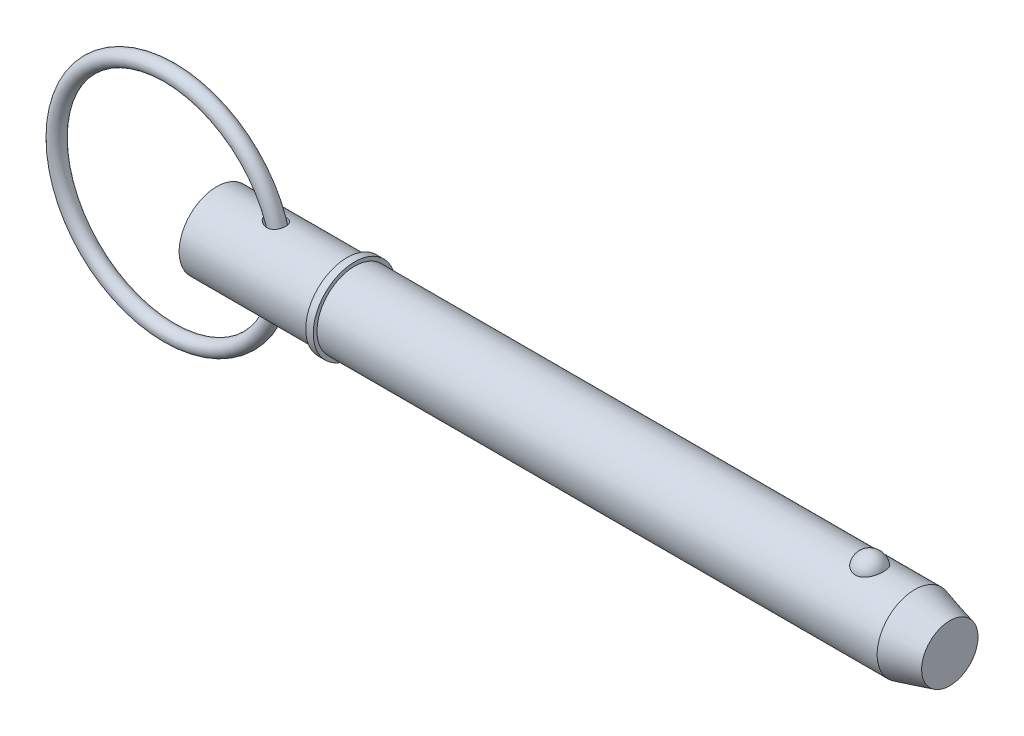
ISO-10303-21;
HEADER;
FILE_DESCRIPTION(('STEP AP214'),'2;1');
FILE_NAME('part.step','',(''),(''),'','','');
FILE_SCHEMA(('AUTOMOTIVE_DESIGN { 1 0 10303 214 1 1 1 1 }'));
ENDSEC;
DATA;
#1=APPLICATION_CONTEXT('core data for automotive mechanical design processes');
#2=APPLICATION_PROTOCOL_DEFINITION('international standard','automotive_design',2000,#1);
#3=PRODUCT_CONTEXT('',#1,'mechanical');
#4=PRODUCT('Part','Part','',(#3));
#5=PRODUCT_RELATED_PRODUCT_CATEGORY('part','',(#4));
#6=PRODUCT_DEFINITION_FORMATION('','',#4);
#7=PRODUCT_DEFINITION_CONTEXT('part definition',#1,'design');
#8=PRODUCT_DEFINITION('design','',#6,#7);
#9=PRODUCT_DEFINITION_SHAPE('','',#8);
#10=(LENGTH_UNIT() NAMED_UNIT(*) SI_UNIT(.MILLI.,.METRE.));
#11=(NAMED_UNIT(*) PLANE_ANGLE_UNIT() SI_UNIT($,.RADIAN.));
#12=(NAMED_UNIT(*) SI_UNIT($,.STERADIAN.) SOLID_ANGLE_UNIT());
#13=UNCERTAINTY_MEASURE_WITH_UNIT(LENGTH_MEASURE(1.E-05),#10,'distance_accuracy_value','');
#14=(GEOMETRIC_REPRESENTATION_CONTEXT(3) GLOBAL_UNCERTAINTY_ASSIGNED_CONTEXT((#13)) GLOBAL_UNIT_ASSIGNED_CONTEXT((#10,
#11,#12)) REPRESENTATION_CONTEXT('',''));
#15=CARTESIAN_POINT('',(0.,0.,0.));
#16=DIRECTION('',(0.,0.,1.));
#17=DIRECTION('',(1.,0.,0.));
#18=AXIS2_PLACEMENT_3D('',#15,#16,#17);
#19=CARTESIAN_POINT('',(-11.9894358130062,0.,0.));
#20=DIRECTION('',(0.,0.,1.));
#21=DIRECTION('',(1.,0.,0.));
#22=AXIS2_PLACEMENT_3D('',#19,#20,#21);
#23=TOROIDAL_SURFACE('',#22,28.575,1.905);
#24=CARTESIAN_POINT('',(18.4905641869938,0.,0.));
#25=VERTEX_POINT('',#24);
#26=VERTEX_LOOP('',#25);
#27=FACE_BOUND('',#26,.T.);
#28=ADVANCED_FACE('P0_F12',(#27),#23,.T.);
#29=CLOSED_SHELL('',(#28));
#30=MANIFOLD_SOLID_BREP('P0_B1',#29);
#31=CARTESIAN_POINT('',(0.,0.,0.));
#32=DIRECTION('',(1.,0.,0.));
#33=DIRECTION('',(0.,0.,-1.));
#34=AXIS2_PLACEMENT_3D('',#31,#32,#33);
#35=CYLINDRICAL_SURFACE('',#34,9.525);
#36=CARTESIAN_POINT('',(12.9513882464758,9.41921920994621,-1.41559473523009));
#37=CARTESIAN_POINT('',(13.0504692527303,9.40163924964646,-1.53256769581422));
#38=CARTESIAN_POINT('',(13.1602600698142,9.38319823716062,-1.6404459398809));
#39=CARTESIAN_POINT('',(13.3966485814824,9.34687220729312,-1.83618480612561));
#40=CARTESIAN_POINT('',(13.5232761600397,9.32898824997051,-1.92400906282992));
#41=CARTESIAN_POINT('',(13.78900694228,9.29593183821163,-2.07784697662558));
#42=CARTESIAN_POINT('',(13.9280753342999,9.28075215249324,-2.14391921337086));
#43=CARTESIAN_POINT('',(14.2153444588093,9.25488828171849,-2.25295850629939));
#44=CARTESIAN_POINT('',(14.3635415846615,9.24420233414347,-2.29593462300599));
#45=CARTESIAN_POINT('',(14.669669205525,9.22859713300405,-2.3579005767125));
#46=CARTESIAN_POINT('',(14.8277567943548,9.22385123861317,-2.37617053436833));
#47=CARTESIAN_POINT('',(15.1447573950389,9.22170813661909,-2.38448481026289));
#48=CARTESIAN_POINT('',(15.3036699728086,9.22430739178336,-2.3745427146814));
#49=CARTESIAN_POINT('',(15.6046561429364,9.2363636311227,-2.32717331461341));
#50=CARTESIAN_POINT('',(15.7470893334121,9.24528216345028,-2.29190131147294));
#51=CARTESIAN_POINT('',(16.0228763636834,9.26842607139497,-2.19642882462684));
#52=CARTESIAN_POINT('',(16.1562346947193,9.28264879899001,-2.1362407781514));
#53=CARTESIAN_POINT('',(16.3991522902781,9.31332263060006,-1.99805318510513));
#54=CARTESIAN_POINT('',(16.5097585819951,9.32951023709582,-1.92182839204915));
#55=CARTESIAN_POINT('',(16.7159974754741,9.36298467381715,-1.75147176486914));
#56=CARTESIAN_POINT('',(16.811631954,9.38027136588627,-1.65734217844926));
#57=CARTESIAN_POINT('',(16.9833240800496,9.41356881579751,-1.45618916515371));
#58=CARTESIAN_POINT('',(17.0597719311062,9.42959946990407,-1.34950141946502));
#59=CARTESIAN_POINT('',(17.1939538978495,9.45905380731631,-1.12462011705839));
#60=CARTESIAN_POINT('',(17.2516877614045,9.4724774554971,-1.00642640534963));
#61=CARTESIAN_POINT('',(17.3474400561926,9.49535683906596,-0.760990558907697));
#62=CARTESIAN_POINT('',(17.3853184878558,9.50478431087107,-0.633691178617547));
#63=CARTESIAN_POINT('',(17.4399027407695,9.51852575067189,-0.374363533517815));
#64=CARTESIAN_POINT('',(17.4566077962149,9.52283953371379,-0.242335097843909));
#65=CARTESIAN_POINT('',(17.4685150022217,9.52590431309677,0.0235692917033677));
#66=CARTESIAN_POINT('',(17.4635842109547,9.52462091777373,0.157451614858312));
#67=CARTESIAN_POINT('',(17.4320243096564,9.5165501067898,0.422467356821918));
#68=CARTESIAN_POINT('',(17.4053947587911,9.50976257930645,0.55360071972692));
#69=CARTESIAN_POINT('',(17.3310009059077,9.49140797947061,0.809490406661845));
#70=CARTESIAN_POINT('',(17.2832204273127,9.47983724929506,0.934241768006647));
#71=CARTESIAN_POINT('',(17.1676219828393,9.453180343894,1.1736825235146));
#72=CARTESIAN_POINT('',(17.0998044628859,9.43809424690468,1.28837214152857));
#73=CARTESIAN_POINT('',(16.9461013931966,9.40614962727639,1.50393386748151));
#74=CARTESIAN_POINT('',(16.8602910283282,9.38929862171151,1.6048606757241));
#75=CARTESIAN_POINT('',(16.6726759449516,9.35566510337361,1.79055313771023));
#76=CARTESIAN_POINT('',(16.5708731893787,9.33888258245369,1.87532077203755));
#77=CARTESIAN_POINT('',(16.3550631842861,9.30741331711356,2.02572386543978));
#78=CARTESIAN_POINT('',(16.2411701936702,9.29270956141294,2.09151983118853));
#79=CARTESIAN_POINT('',(16.0037488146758,9.26681293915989,2.20343355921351));
#80=CARTESIAN_POINT('',(15.8802207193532,9.25561996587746,2.24955191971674));
#81=CARTESIAN_POINT('',(15.6262451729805,9.23779438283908,2.32167613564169));
#82=CARTESIAN_POINT('',(15.4957570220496,9.23119272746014,2.34754561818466));
#83=CARTESIAN_POINT('',(15.2322153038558,9.22318493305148,2.37881082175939));
#84=CARTESIAN_POINT('',(15.0991611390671,9.22178001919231,2.38420171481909));
#85=CARTESIAN_POINT('',(14.8267609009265,9.22414647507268,2.37503099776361));
#86=CARTESIAN_POINT('',(14.6874545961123,9.22819578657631,2.35939810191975));
#87=CARTESIAN_POINT('',(14.412976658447,9.24129253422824,2.30756034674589));
#88=CARTESIAN_POINT('',(14.2778066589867,9.25034191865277,2.27134746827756));
#89=CARTESIAN_POINT('',(14.0027915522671,9.27334688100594,2.1756145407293));
#90=CARTESIAN_POINT('',(13.8635960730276,9.28766658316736,2.11431132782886));
#91=CARTESIAN_POINT('',(13.5969045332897,9.31925368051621,1.97041856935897));
#92=CARTESIAN_POINT('',(13.4694182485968,9.33652350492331,1.88781145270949));
#93=CARTESIAN_POINT('',(13.2243568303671,9.37286659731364,1.69844580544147));
#94=CARTESIAN_POINT('',(13.1075060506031,9.39198626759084,1.59075211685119));
#95=CARTESIAN_POINT('',(12.8957171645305,9.42881110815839,1.35544651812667));
#96=CARTESIAN_POINT('',(12.8007455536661,9.44651841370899,1.22786557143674));
#97=CARTESIAN_POINT('',(12.6580495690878,9.4741137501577,0.9887243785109));
#98=CARTESIAN_POINT('',(12.604453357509,9.4848570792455,0.880756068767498));
#99=CARTESIAN_POINT('',(12.515693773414,9.50295777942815,0.657225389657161));
#100=CARTESIAN_POINT('',(12.4805142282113,9.51031812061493,0.541669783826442));
#101=CARTESIAN_POINT('',(12.4305797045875,9.52083647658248,0.305475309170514));
#102=CARTESIAN_POINT('',(12.4159122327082,9.52397648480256,0.18481691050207));
#103=CARTESIAN_POINT('',(12.408320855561,9.52559626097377,-0.0572308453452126));
#104=CARTESIAN_POINT('',(12.4153963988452,9.52407614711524,-0.178620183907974));
#105=CARTESIAN_POINT('',(12.4495068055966,9.51684301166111,-0.409566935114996));
#106=CARTESIAN_POINT('',(12.4750931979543,9.51143444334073,-0.519353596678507));
#107=CARTESIAN_POINT('',(12.543120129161,9.49733710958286,-0.73328523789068));
#108=CARTESIAN_POINT('',(12.5855568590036,9.4886490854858,-0.837431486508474));
#109=CARTESIAN_POINT('',(12.6780792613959,9.47023833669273,-1.02356028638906));
#110=CARTESIAN_POINT('',(12.7261842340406,9.46084463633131,-1.10657511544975));
#111=CARTESIAN_POINT('',(12.8319313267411,9.44081892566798,-1.26610577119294));
#112=CARTESIAN_POINT('',(12.8895756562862,9.43018662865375,-1.34262008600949));
#113=CARTESIAN_POINT('',(12.9513882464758,9.41921920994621,-1.41559473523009));
#114=B_SPLINE_CURVE_WITH_KNOTS('',3,(#36,#37,#38,#39,#40,#41,#42,#43,#44,#45,#46,#47,#48,#49,
#50,#51,#52,#53,#54,#55,#56,#57,#58,#59,#60,#61,#62,#63,#64,#65,#66,#67,#68,#69,#70,#71,#72,#73,
#74,#75,#76,#77,#78,#79,#80,#81,#82,#83,#84,#85,#86,#87,#88,#89,#90,#91,#92,#93,#94,#95,#96,#97,
#98,#99,#100,#101,#102,#103,#104,#105,#106,#107,#108,#109,#110,#111,#112,#113),.UNSPECIFIED.,
.T.,.F.,(4,2,2,2,2,2,2,2,2,2,2,2,2,2,2,2,2,2,2,2,2,2,2,2,2,2,2,2,2,2,2,2,2,2,2,2,2,2,4),(0.,
0.462524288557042,0.925880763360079,1.3879789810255,1.8498957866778,2.3250010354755,
2.79987752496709,3.23851602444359,3.67693583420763,4.08084875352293,4.48471100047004,
4.87953549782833,5.27436531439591,5.67194282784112,6.0695347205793,6.46957303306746,
6.86961947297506,7.26997240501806,7.67031642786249,8.06901977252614,8.46767421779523,
8.86284969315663,9.25801315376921,9.65581560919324,10.0537118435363,10.4726706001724,
10.8917927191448,11.3481090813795,11.8048030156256,12.2824769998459,12.7594145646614,
13.1209614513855,13.4821903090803,13.8449555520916,14.2077115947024,14.5447865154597,
14.881785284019,15.170268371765,15.4588183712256),.UNSPECIFIED.);
#115=CARTESIAN_POINT('',(12.9513882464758,9.41921920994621,-1.41559473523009));
#116=VERTEX_POINT('',#115);
#117=EDGE_CURVE('P1_E42',#116,#116,#114,.T.);
#118=ORIENTED_EDGE('',*,*,#117,.T.);
#119=EDGE_LOOP('',(#118));
#120=FACE_BOUND('',#119,.T.);
#121=CARTESIAN_POINT('',(0.,0.,0.));
#122=DIRECTION('',(1.,0.,0.));
#123=DIRECTION('',(0.,0.,-1.));
#124=AXIS2_PLACEMENT_3D('',#121,#122,#123);
#125=CIRCLE('',#124,9.525);
#126=CARTESIAN_POINT('',(0.,0.,-9.525));
#127=VERTEX_POINT('',#126);
#128=EDGE_CURVE('P1_E9',#127,#127,#125,.T.);
#129=ORIENTED_EDGE('',*,*,#128,.T.);
#130=EDGE_LOOP('',(#129));
#131=FACE_BOUND('',#130,.T.);
#132=CARTESIAN_POINT('',(33.025,0.,0.));
#133=DIRECTION('',(1.,0.,0.));
#134=DIRECTION('',(0.,0.,-1.));
#135=AXIS2_PLACEMENT_3D('',#132,#133,#134);
#136=CIRCLE('',#135,9.525);
#137=CARTESIAN_POINT('',(33.025,0.,-9.525));
#138=VERTEX_POINT('',#137);
#139=EDGE_CURVE('P1_E25',#138,#138,#136,.T.);
#140=ORIENTED_EDGE('',*,*,#139,.F.);
#141=EDGE_LOOP('',(#140));
#142=FACE_BOUND('',#141,.T.);
#143=CARTESIAN_POINT('',(12.9513882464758,-9.41921920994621,-1.41559473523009));
#144=CARTESIAN_POINT('',(12.8706569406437,-9.43354320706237,-1.32028288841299));
#145=CARTESIAN_POINT('',(12.7970077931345,-9.44729974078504,-1.21890449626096));
#146=CARTESIAN_POINT('',(12.6667099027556,-9.47239055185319,-1.00546491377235));
#147=CARTESIAN_POINT('',(12.6100480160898,-9.48372669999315,-0.893412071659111));
#148=CARTESIAN_POINT('',(12.5163428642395,-9.50281544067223,-0.66020233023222));
#149=CARTESIAN_POINT('',(12.4794216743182,-9.51054569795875,-0.538993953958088));
#150=CARTESIAN_POINT('',(12.4282252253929,-9.52133525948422,-0.29167282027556));
#151=CARTESIAN_POINT('',(12.4139371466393,-9.52439720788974,-0.165562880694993));
#152=CARTESIAN_POINT('',(12.4092595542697,-9.52539668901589,0.0763263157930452));
#153=CARTESIAN_POINT('',(12.4169377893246,-9.5237485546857,0.192070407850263));
#154=CARTESIAN_POINT('',(12.4515961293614,-9.51640070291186,0.420478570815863));
#155=CARTESIAN_POINT('',(12.4785770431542,-9.51070081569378,0.533142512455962));
#156=CARTESIAN_POINT('',(12.5496371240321,-9.49599978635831,0.750537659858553));
#157=CARTESIAN_POINT('',(12.5934215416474,-9.48705569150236,0.855370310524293));
#158=CARTESIAN_POINT('',(12.6960201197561,-9.46670226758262,1.05710432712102));
#159=CARTESIAN_POINT('',(12.754838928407,-9.45529217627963,1.15400322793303));
#160=CARTESIAN_POINT('',(12.8926588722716,-9.42958102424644,1.34883014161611));
#161=CARTESIAN_POINT('',(12.9731843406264,-9.41509922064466,1.44565277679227));
#162=CARTESIAN_POINT('',(13.1473692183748,-9.38554264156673,1.62653953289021));
#163=CARTESIAN_POINT('',(13.2410364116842,-9.37046751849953,1.71059603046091));
#164=CARTESIAN_POINT('',(13.4543924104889,-9.33867330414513,1.87697964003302));
#165=CARTESIAN_POINT('',(13.5758667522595,-9.32205896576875,1.95704323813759));
#166=CARTESIAN_POINT('',(13.8299208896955,-9.29140277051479,2.09777392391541));
#167=CARTESIAN_POINT('',(13.9625074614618,-9.27736250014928,2.15842906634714));
#168=CARTESIAN_POINT('',(14.2477938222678,-9.25234849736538,2.26337318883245));
#169=CARTESIAN_POINT('',(14.4012368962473,-9.2417532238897,2.30575283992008));
#170=CARTESIAN_POINT('',(14.7134258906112,-9.22706044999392,2.36387471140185));
#171=CARTESIAN_POINT('',(14.8721705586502,-9.22296142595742,2.37962317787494));
#172=CARTESIAN_POINT('',(15.1841930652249,-9.22219798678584,2.38258156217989));
#173=CARTESIAN_POINT('',(15.3374581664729,-9.22526675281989,2.37081567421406));
#174=CARTESIAN_POINT('',(15.6390558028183,-9.23821642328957,2.31984408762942));
#175=CARTESIAN_POINT('',(15.7873916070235,-9.24809271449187,2.28065697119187));
#176=CARTESIAN_POINT('',(16.0605055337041,-9.27231045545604,2.17997072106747));
#177=CARTESIAN_POINT('',(16.1861988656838,-9.28616347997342,2.12082794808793));
#178=CARTESIAN_POINT('',(16.4248737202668,-9.31689725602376,1.9814435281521));
#179=CARTESIAN_POINT('',(16.5378583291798,-9.33377726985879,1.90120701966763));
#180=CARTESIAN_POINT('',(16.7424913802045,-9.36766057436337,1.72629138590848));
#181=CARTESIAN_POINT('',(16.8349077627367,-9.38461836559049,1.63249912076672));
#182=CARTESIAN_POINT('',(17.0025959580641,-9.41752009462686,1.43052052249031));
#183=CARTESIAN_POINT('',(17.0778684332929,-9.43346407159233,1.32233474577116));
#184=CARTESIAN_POINT('',(17.2093311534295,-9.46256896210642,1.09477833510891));
#185=CARTESIAN_POINT('',(17.2655443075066,-9.47573320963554,0.975421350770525));
#186=CARTESIAN_POINT('',(17.3577240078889,-9.49788660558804,0.728764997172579));
#187=CARTESIAN_POINT('',(17.3936897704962,-9.5068755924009,0.601465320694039));
#188=CARTESIAN_POINT('',(17.4447894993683,-9.51977728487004,0.341392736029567));
#189=CARTESIAN_POINT('',(17.4597470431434,-9.52364698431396,0.208583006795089));
#190=CARTESIAN_POINT('',(17.467935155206,-9.52575588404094,-0.0577507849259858));
#191=CARTESIAN_POINT('',(17.4611651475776,-9.52399493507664,-0.191274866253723));
#192=CARTESIAN_POINT('',(17.4259933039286,-9.51501704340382,-0.455658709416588));
#193=CARTESIAN_POINT('',(17.3975278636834,-9.50778405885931,-0.586509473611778));
#194=CARTESIAN_POINT('',(17.3195245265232,-9.48862442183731,-0.841413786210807));
#195=CARTESIAN_POINT('',(17.2699864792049,-9.47669773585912,-0.965467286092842));
#196=CARTESIAN_POINT('',(17.1510794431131,-9.44947793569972,-1.20302860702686));
#197=CARTESIAN_POINT('',(17.0817421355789,-9.43419020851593,-1.31655289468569));
#198=CARTESIAN_POINT('',(16.9249035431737,-9.40193593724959,-1.52999797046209));
#199=CARTESIAN_POINT('',(16.8374037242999,-9.38496952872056,-1.62991985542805));
#200=CARTESIAN_POINT('',(16.6472525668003,-9.35139745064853,-1.81261591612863));
#201=CARTESIAN_POINT('',(16.544718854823,-9.33479003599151,-1.89551219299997));
#202=CARTESIAN_POINT('',(16.3268885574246,-9.30366076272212,-2.04284430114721));
#203=CARTESIAN_POINT('',(16.2115933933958,-9.28913867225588,-2.10728218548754));
#204=CARTESIAN_POINT('',(15.9721327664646,-9.26380878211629,-2.21598517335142));
#205=CARTESIAN_POINT('',(15.8480095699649,-9.25298455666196,-2.26033977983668));
#206=CARTESIAN_POINT('',(15.5939970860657,-9.23601616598,-2.32870721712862));
#207=CARTESIAN_POINT('',(15.4641070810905,-9.22987258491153,-2.35271750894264));
#208=CARTESIAN_POINT('',(15.1982340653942,-9.22261892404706,-2.38099747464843));
#209=CARTESIAN_POINT('',(15.0621840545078,-9.22166165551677,-2.38466791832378));
#210=CARTESIAN_POINT('',(14.7911713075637,-9.22504733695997,-2.37153091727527));
#211=CARTESIAN_POINT('',(14.6562088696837,-9.2293916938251,-2.35471803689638));
#212=CARTESIAN_POINT('',(14.3799999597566,-9.24325361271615,-2.29972931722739));
#213=CARTESIAN_POINT('',(14.2390842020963,-9.25314817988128,-2.2599897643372));
#214=CARTESIAN_POINT('',(13.9651910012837,-9.27709186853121,-2.15959208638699));
#215=CARTESIAN_POINT('',(13.8322212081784,-9.29114491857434,-2.09891417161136));
#216=CARTESIAN_POINT('',(13.5621642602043,-9.32369066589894,-1.94960068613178));
#217=CARTESIAN_POINT('',(13.4264724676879,-9.34251276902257,-1.85849626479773));
#218=CARTESIAN_POINT('',(13.1736579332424,-9.38095091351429,-1.6535412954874));
#219=CARTESIAN_POINT('',(13.0565182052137,-9.40056620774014,-1.53971177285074));
#220=CARTESIAN_POINT('',(12.9513882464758,-9.41921920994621,-1.41559473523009));
#221=B_SPLINE_CURVE_WITH_KNOTS('',3,(#143,#144,#145,#146,#147,#148,#149,#150,#151,#152,#153,
#154,#155,#156,#157,#158,#159,#160,#161,#162,#163,#164,#165,#166,#167,#168,#169,#170,#171,#172,
#173,#174,#175,#176,#177,#178,#179,#180,#181,#182,#183,#184,#185,#186,#187,#188,#189,#190,#191,
#192,#193,#194,#195,#196,#197,#198,#199,#200,#201,#202,#203,#204,#205,#206,#207,#208,#209,#210,
#211,#212,#213,#214,#215,#216,#217,#218,#219,#220),.UNSPECIFIED.,.T.,.F.,(4,2,2,2,2,2,2,2,2,2,2,
2,2,2,2,2,2,2,2,2,2,2,2,2,2,2,2,2,2,2,2,2,2,2,2,2,2,2,4),(0.,0.376746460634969,0.75320065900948,
1.13195666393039,1.51049805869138,1.85679105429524,2.20309856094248,2.54359033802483,
2.88418751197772,3.26301611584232,3.64207005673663,4.07954912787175,4.51729693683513,
4.99355673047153,5.46970480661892,5.92841231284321,6.38680927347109,6.80346940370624,
7.22002812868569,7.61642768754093,8.01281192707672,8.40871801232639,8.80463942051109,
9.20386620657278,9.60310357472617,10.0035159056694,10.4039310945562,10.8037091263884,
11.2034549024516,11.6002252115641,11.9969513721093,12.3918916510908,12.7868812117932,
13.1934480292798,13.6001227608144,14.038511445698,14.4773156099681,14.9683748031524,
15.4589817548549),.UNSPECIFIED.);
#222=CARTESIAN_POINT('',(12.9513882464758,-9.41921920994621,-1.41559473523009));
#223=VERTEX_POINT('',#222);
#224=EDGE_CURVE('P1_E17',#223,#223,#221,.T.);
#225=ORIENTED_EDGE('',*,*,#224,.T.);
#226=EDGE_LOOP('',(#225));
#227=FACE_BOUND('',#226,.T.);
#228=ADVANCED_FACE('P1_F13',(#120,#131,#142,#227),#35,.T.);
#229=CARTESIAN_POINT('',(0.,0.,0.));
#230=DIRECTION('',(1.,0.,0.));
#231=DIRECTION('',(0.,0.,-1.));
#232=AXIS2_PLACEMENT_3D('',#229,#230,#231);
#233=CYLINDRICAL_SURFACE('',#232,9.525);
#234=CARTESIAN_POINT('',(176.843054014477,0.,0.));
#235=DIRECTION('',(1.,0.,0.));
#236=DIRECTION('',(0.,0.,-1.));
#237=AXIS2_PLACEMENT_3D('',#234,#235,#236);
#238=CIRCLE('',#237,9.525);
#239=CARTESIAN_POINT('',(176.843054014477,0.,-9.525));
#240=VERTEX_POINT('',#239);
#241=EDGE_CURVE('P1_E99',#240,#240,#238,.T.);
#242=ORIENTED_EDGE('',*,*,#241,.F.);
#243=EDGE_LOOP('',(#242));
#244=FACE_BOUND('',#243,.T.);
#245=CARTESIAN_POINT('',(34.93,0.,0.));
#246=DIRECTION('',(1.,0.,0.));
#247=DIRECTION('',(0.,0.,-1.));
#248=AXIS2_PLACEMENT_3D('',#245,#246,#247);
#249=CIRCLE('',#248,9.525);
#250=CARTESIAN_POINT('',(34.93,0.,-9.525));
#251=VERTEX_POINT('',#250);
#252=EDGE_CURVE('P1_E96',#251,#251,#249,.T.);
#253=ORIENTED_EDGE('',*,*,#252,.T.);
#254=EDGE_LOOP('',(#253));
#255=FACE_BOUND('',#254,.T.);
#256=CARTESIAN_POINT('',(165.445757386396,8.80405803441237,3.63513233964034));
#257=CARTESIAN_POINT('',(165.351676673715,8.80405953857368,3.63513053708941));
#258=CARTESIAN_POINT('',(165.257561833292,8.80561325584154,3.63137461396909));
#259=CARTESIAN_POINT('',(165.070012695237,8.81177748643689,3.61638665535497));
#260=CARTESIAN_POINT('',(164.976578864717,8.81638992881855,3.60514990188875));
#261=CARTESIAN_POINT('',(164.697945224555,8.83467114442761,3.56024627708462));
#262=CARTESIAN_POINT('',(164.514691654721,8.85278327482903,3.51538626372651));
#263=CARTESIAN_POINT('',(164.159509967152,8.89871214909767,3.39742145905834));
#264=CARTESIAN_POINT('',(163.987553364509,8.92650327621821,3.32439116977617));
#265=CARTESIAN_POINT('',(163.658707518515,8.98874819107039,3.15220244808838));
#266=CARTESIAN_POINT('',(163.501811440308,9.02319893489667,3.05305594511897));
#267=CARTESIAN_POINT('',(163.202214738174,9.09629186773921,2.82797815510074));
#268=CARTESIAN_POINT('',(163.060060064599,9.13502685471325,2.70135138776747));
#269=CARTESIAN_POINT('',(162.798299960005,9.21186572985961,2.42641932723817));
#270=CARTESIAN_POINT('',(162.678701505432,9.24996941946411,2.27810735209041));
#271=CARTESIAN_POINT('',(162.459645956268,9.32341082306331,1.95652290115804));
#272=CARTESIAN_POINT('',(162.361317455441,9.35855090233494,1.78243511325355));
#273=CARTESIAN_POINT('',(162.193819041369,9.42045142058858,1.419372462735));
#274=CARTESIAN_POINT('',(162.124651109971,9.44721128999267,1.23039658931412));
#275=CARTESIAN_POINT('',(162.016199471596,9.48990641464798,0.840370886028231));
#276=CARTESIAN_POINT('',(161.977288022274,9.50570658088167,0.639202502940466));
#277=CARTESIAN_POINT('',(161.931555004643,9.52433146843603,0.232664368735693));
#278=CARTESIAN_POINT('',(161.924732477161,9.52715657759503,0.0272947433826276));
#279=CARTESIAN_POINT('',(161.943255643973,9.51956918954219,-0.380478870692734));
#280=CARTESIAN_POINT('',(161.968405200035,9.50923740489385,-0.582893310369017));
#281=CARTESIAN_POINT('',(162.05002537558,9.47651897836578,-0.980293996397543));
#282=CARTESIAN_POINT('',(162.106496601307,9.45413210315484,-1.17528009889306));
#283=CARTESIAN_POINT('',(162.249719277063,9.39954044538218,-1.55263697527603));
#284=CARTESIAN_POINT('',(162.336512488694,9.36732213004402,-1.73498993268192));
#285=CARTESIAN_POINT('',(162.538610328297,9.29640700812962,-2.08177763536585));
#286=CARTESIAN_POINT('',(162.653917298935,9.25770966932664,-2.24621090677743));
#287=CARTESIAN_POINT('',(162.911264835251,9.17775604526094,-2.55338333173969));
#288=CARTESIAN_POINT('',(163.053434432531,9.136488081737,-2.69601150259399));
#289=CARTESIAN_POINT('',(163.36089985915,9.05620497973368,-2.95451229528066));
#290=CARTESIAN_POINT('',(163.526193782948,9.01718965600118,-3.070387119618));
#291=CARTESIAN_POINT('',(163.872052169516,8.94680019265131,-3.26976836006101));
#292=CARTESIAN_POINT('',(164.052227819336,8.91528408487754,-3.35389750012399));
#293=CARTESIAN_POINT('',(164.425651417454,8.86272514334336,-3.49043503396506));
#294=CARTESIAN_POINT('',(164.618894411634,8.84167836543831,-3.54285537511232));
#295=CARTESIAN_POINT('',(165.002503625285,8.81348056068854,-3.61241306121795));
#296=CARTESIAN_POINT('',(165.192525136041,8.80568348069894,-3.6311933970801));
#297=CARTESIAN_POINT('',(165.573190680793,8.80289410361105,-3.63795342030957));
#298=CARTESIAN_POINT('',(165.763834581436,8.80789922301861,-3.62593932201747));
#299=CARTESIAN_POINT('',(166.134007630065,8.82974915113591,-3.57238430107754));
#300=CARTESIAN_POINT('',(166.313697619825,8.84621463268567,-3.53178890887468));
#301=CARTESIAN_POINT('',(166.663422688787,8.88875330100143,-3.42331083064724));
#302=CARTESIAN_POINT('',(166.833456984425,8.91482726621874,-3.35542593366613));
#303=CARTESIAN_POINT('',(167.163237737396,8.97448239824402,-3.19248225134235));
#304=CARTESIAN_POINT('',(167.322680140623,9.00821446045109,-3.09686474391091));
#305=CARTESIAN_POINT('',(167.623513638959,9.07935398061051,-2.88162736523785));
#306=CARTESIAN_POINT('',(167.764900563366,9.11676228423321,-2.76200196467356));
#307=CARTESIAN_POINT('',(168.03331931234,9.19347419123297,-2.49516285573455));
#308=CARTESIAN_POINT('',(168.159275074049,9.23277872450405,-2.34686614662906));
#309=CARTESIAN_POINT('',(168.385522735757,9.3073761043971,-2.0309368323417));
#310=CARTESIAN_POINT('',(168.48581004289,9.34266823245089,-1.86330077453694));
#311=CARTESIAN_POINT('',(168.661514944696,9.40674710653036,-1.50744893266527));
#312=CARTESIAN_POINT('',(168.736041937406,9.43529176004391,-1.31874876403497));
#313=CARTESIAN_POINT('',(168.85416505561,9.48144132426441,-0.930631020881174));
#314=CARTESIAN_POINT('',(168.897760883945,9.49904612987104,-0.731213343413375));
#315=CARTESIAN_POINT('',(168.953158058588,9.5215314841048,-0.327147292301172));
#316=CARTESIAN_POINT('',(168.964935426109,9.52640243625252,-0.12249509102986));
#317=CARTESIAN_POINT('',(168.956382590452,9.5228957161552,0.286018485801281));
#318=CARTESIAN_POINT('',(168.93605305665,9.5145183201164,0.489879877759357));
#319=CARTESIAN_POINT('',(168.863884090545,9.48544083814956,0.889994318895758));
#320=CARTESIAN_POINT('',(168.812199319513,9.46480124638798,1.08627971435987));
#321=CARTESIAN_POINT('',(168.678491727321,9.4133389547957,1.46682086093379));
#322=CARTESIAN_POINT('',(168.596466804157,9.38251554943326,1.65107577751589));
#323=CARTESIAN_POINT('',(168.40319292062,9.31365636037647,2.00346348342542));
#324=CARTESIAN_POINT('',(168.291783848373,9.27558138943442,2.17150083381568));
#325=CARTESIAN_POINT('',(168.042294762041,9.19638714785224,2.48563115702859));
#326=CARTESIAN_POINT('',(167.904216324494,9.15526805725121,2.63172542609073));
#327=CARTESIAN_POINT('',(167.604843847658,9.07465393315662,2.89750997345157));
#328=CARTESIAN_POINT('',(167.443610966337,9.03515496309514,3.01726776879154));
#329=CARTESIAN_POINT('',(167.101613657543,8.96227564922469,3.22732920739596));
#330=CARTESIAN_POINT('',(166.920841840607,8.92889763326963,3.31762165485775));
#331=CARTESIAN_POINT('',(166.551445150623,8.8734538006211,3.46314419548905));
#332=CARTESIAN_POINT('',(166.36332371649,8.85102983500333,3.51950082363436));
#333=CARTESIAN_POINT('',(166.07578699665,8.82666967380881,3.57993683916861));
#334=CARTESIAN_POINT('',(165.979133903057,8.82009725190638,3.5960621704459));
#335=CARTESIAN_POINT('',(165.784677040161,8.81020897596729,3.62022512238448));
#336=CARTESIAN_POINT('',(165.68687410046,8.80689090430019,3.62826825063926));
#337=CARTESIAN_POINT('',(165.541224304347,8.80445615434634,3.63416760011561));
#338=CARTESIAN_POINT('',(165.493495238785,8.80405727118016,3.63513325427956));
#339=CARTESIAN_POINT('',(165.445757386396,8.80405803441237,3.63513233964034));
#340=B_SPLINE_CURVE_WITH_KNOTS('',3,(#256,#257,#258,#259,#260,#261,#262,#263,#264,#265,#266,
#267,#268,#269,#270,#271,#272,#273,#274,#275,#276,#277,#278,#279,#280,#281,#282,#283,#284,#285,
#286,#287,#288,#289,#290,#291,#292,#293,#294,#295,#296,#297,#298,#299,#300,#301,#302,#303,#304,
#305,#306,#307,#308,#309,#310,#311,#312,#313,#314,#315,#316,#317,#318,#319,#320,#321,#322,#323,
#324,#325,#326,#327,#328,#329,#330,#331,#332,#333,#334,#335,#336,#337,#338,#339),.UNSPECIFIED.,
.T.,.F.,(4,2,2,2,2,2,2,2,2,2,2,2,2,2,2,2,2,2,2,2,2,2,2,2,2,2,2,2,2,2,2,2,2,2,2,2,2,2,2,2,2,4),
(0.,0.282202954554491,0.564584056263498,1.13017050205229,1.69427128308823,2.25811483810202,
2.83836627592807,3.41879688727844,4.02497117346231,4.63118665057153,5.24474754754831,
5.85829010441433,6.46808687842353,7.07789545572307,7.6885472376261,8.299249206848,
8.91296283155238,9.52662591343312,10.1275338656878,10.7282152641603,11.2986646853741,
11.8689989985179,12.4213015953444,12.973648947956,13.5380053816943,14.1024919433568,
14.695298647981,15.2882113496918,15.8999469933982,16.5116885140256,17.1238909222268,
17.7360805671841,18.3452748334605,18.9545113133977,19.567138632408,20.179729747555,
20.7907316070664,21.4019653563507,21.9915938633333,22.2859053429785,22.5800161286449,
22.7232098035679),.UNSPECIFIED.);
#341=CARTESIAN_POINT('',(165.445757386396,8.80405803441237,3.63513233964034));
#342=VERTEX_POINT('',#341);
#343=EDGE_CURVE('P1_E34',#342,#342,#340,.T.);
#344=ORIENTED_EDGE('',*,*,#343,.T.);
#345=EDGE_LOOP('',(#344));
#346=FACE_BOUND('',#345,.T.);
#347=ADVANCED_FACE('P1_F46',(#244,#255,#346),#233,.T.);
#348=CARTESIAN_POINT('',(0.,0.,0.));
#349=DIRECTION('',(-1.,0.,0.));
#350=DIRECTION('',(0.,0.,1.));
#351=AXIS2_PLACEMENT_3D('',#348,#349,#350);
#352=PLANE('',#351);
#353=ORIENTED_EDGE('',*,*,#128,.F.);
#354=EDGE_LOOP('',(#353));
#355=FACE_BOUND('',#354,.T.);
#356=ADVANCED_FACE('P1_F15',(#355),#352,.T.);
#357=CARTESIAN_POINT('',(33.025,9.525,0.));
#358=DIRECTION('',(-1.,0.,0.));
#359=DIRECTION('',(0.,0.,1.));
#360=AXIS2_PLACEMENT_3D('',#357,#358,#359);
#361=PLANE('',#360);
#362=ORIENTED_EDGE('',*,*,#139,.T.);
#363=EDGE_LOOP('',(#362));
#364=FACE_BOUND('',#363,.T.);
#365=CARTESIAN_POINT('',(33.025,0.,0.));
#366=DIRECTION('',(1.,0.,0.));
#367=DIRECTION('',(0.,0.,-1.));
#368=AXIS2_PLACEMENT_3D('',#365,#366,#367);
#369=CIRCLE('',#368,10.4775);
#370=CARTESIAN_POINT('',(33.025,0.,-10.4775));
#371=VERTEX_POINT('',#370);
#372=EDGE_CURVE('P1_E30',#371,#371,#369,.T.);
#373=ORIENTED_EDGE('',*,*,#372,.F.);
#374=EDGE_LOOP('',(#373));
#375=FACE_BOUND('',#374,.T.);
#376=ADVANCED_FACE('P1_F81',(#364,#375),#361,.T.);
#377=CARTESIAN_POINT('',(0.,0.,0.));
#378=DIRECTION('',(1.,0.,0.));
#379=DIRECTION('',(0.,0.,-1.));
#380=AXIS2_PLACEMENT_3D('',#377,#378,#379);
#381=CYLINDRICAL_SURFACE('',#380,10.4775);
#382=ORIENTED_EDGE('',*,*,#372,.T.);
#383=EDGE_LOOP('',(#382));
#384=FACE_BOUND('',#383,.T.);
#385=CARTESIAN_POINT('',(34.93,0.,0.));
#386=DIRECTION('',(1.,0.,0.));
#387=DIRECTION('',(0.,0.,-1.));
#388=AXIS2_PLACEMENT_3D('',#385,#386,#387);
#389=CIRCLE('',#388,10.4775);
#390=CARTESIAN_POINT('',(34.93,0.,-10.4775));
#391=VERTEX_POINT('',#390);
#392=EDGE_CURVE('P1_E95',#391,#391,#389,.T.);
#393=ORIENTED_EDGE('',*,*,#392,.F.);
#394=EDGE_LOOP('',(#393));
#395=FACE_BOUND('',#394,.T.);
#396=ADVANCED_FACE('P1_F68',(#384,#395),#381,.T.);
#397=CARTESIAN_POINT('',(34.93,10.4775,0.));
#398=DIRECTION('',(1.,0.,0.));
#399=DIRECTION('',(0.,0.,-1.));
#400=AXIS2_PLACEMENT_3D('',#397,#398,#399);
#401=PLANE('',#400);
#402=ORIENTED_EDGE('',*,*,#392,.T.);
#403=EDGE_LOOP('',(#402));
#404=FACE_BOUND('',#403,.T.);
#405=ORIENTED_EDGE('',*,*,#252,.F.);
#406=EDGE_LOOP('',(#405));
#407=FACE_BOUND('',#406,.T.);
#408=ADVANCED_FACE('P1_F62',(#404,#407),#401,.T.);
#409=CARTESIAN_POINT('',(185.73,0.,0.));
#410=DIRECTION('',(-1.,0.,0.));
#411=DIRECTION('',(0.,0.,1.));
#412=AXIS2_PLACEMENT_3D('',#409,#410,#411);
#413=CONICAL_SURFACE('',#412,7.14375000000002,0.26179938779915);
#414=ORIENTED_EDGE('',*,*,#241,.T.);
#415=EDGE_LOOP('',(#414));
#416=FACE_BOUND('',#415,.T.);
#417=CARTESIAN_POINT('',(185.73,0.,0.));
#418=DIRECTION('',(1.,0.,0.));
#419=DIRECTION('',(0.,0.,-1.));
#420=AXIS2_PLACEMENT_3D('',#417,#418,#419);
#421=CIRCLE('',#420,7.14375000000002);
#422=CARTESIAN_POINT('',(185.73,0.,-7.14375000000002));
#423=VERTEX_POINT('',#422);
#424=EDGE_CURVE('P1_E41',#423,#423,#421,.T.);
#425=ORIENTED_EDGE('',*,*,#424,.F.);
#426=EDGE_LOOP('',(#425));
#427=FACE_BOUND('',#426,.T.);
#428=ADVANCED_FACE('P1_F59',(#416,#427),#413,.T.);
#429=CARTESIAN_POINT('',(185.73,7.14375000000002,0.));
#430=DIRECTION('',(1.,0.,0.));
#431=DIRECTION('',(0.,0.,-1.));
#432=AXIS2_PLACEMENT_3D('',#429,#430,#431);
#433=PLANE('',#432);
#434=ORIENTED_EDGE('',*,*,#424,.T.);
#435=EDGE_LOOP('',(#434));
#436=FACE_BOUND('',#435,.T.);
#437=ADVANCED_FACE('P1_F55',(#436),#433,.T.);
#438=CARTESIAN_POINT('',(165.445757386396,8.5725,0.));
#439=DIRECTION('',(-1.,0.,0.));
#440=DIRECTION('',(0.,-1.,0.));
#441=AXIS2_PLACEMENT_3D('',#438,#439,#440);
#442=SPHERICAL_SURFACE('',#441,3.64249999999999);
#443=ORIENTED_EDGE('',*,*,#343,.F.);
#444=EDGE_LOOP('',(#443));
#445=FACE_BOUND('',#444,.T.);
#446=ADVANCED_FACE('P1_F50',(#445),#442,.T.);
#447=CARTESIAN_POINT('',(-11.9894358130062,0.,0.));
#448=DIRECTION('',(0.,0.,1.));
#449=DIRECTION('',(1.,0.,0.));
#450=AXIS2_PLACEMENT_3D('',#447,#448,#449);
#451=TOROIDAL_SURFACE('',#450,28.575,2.38125);
#452=ORIENTED_EDGE('',*,*,#224,.F.);
#453=EDGE_LOOP('',(#452));
#454=FACE_BOUND('',#453,.T.);
#455=ORIENTED_EDGE('',*,*,#117,.F.);
#456=EDGE_LOOP('',(#455));
#457=FACE_BOUND('',#456,.T.);
#458=ADVANCED_FACE('P1_F54',(#454,#457),#451,.F.);
#459=CLOSED_SHELL('',(#228,#347,#356,#376,#396,#408,#428,#437,#446,#458));
#460=MANIFOLD_SOLID_BREP('P1_B1',#459);
#461=ADVANCED_BREP_SHAPE_REPRESENTATION('',(#18,#30,#460),#14);
#462=SHAPE_DEFINITION_REPRESENTATION(#9,#461);
ENDSEC;
END-ISO-10303-21;
